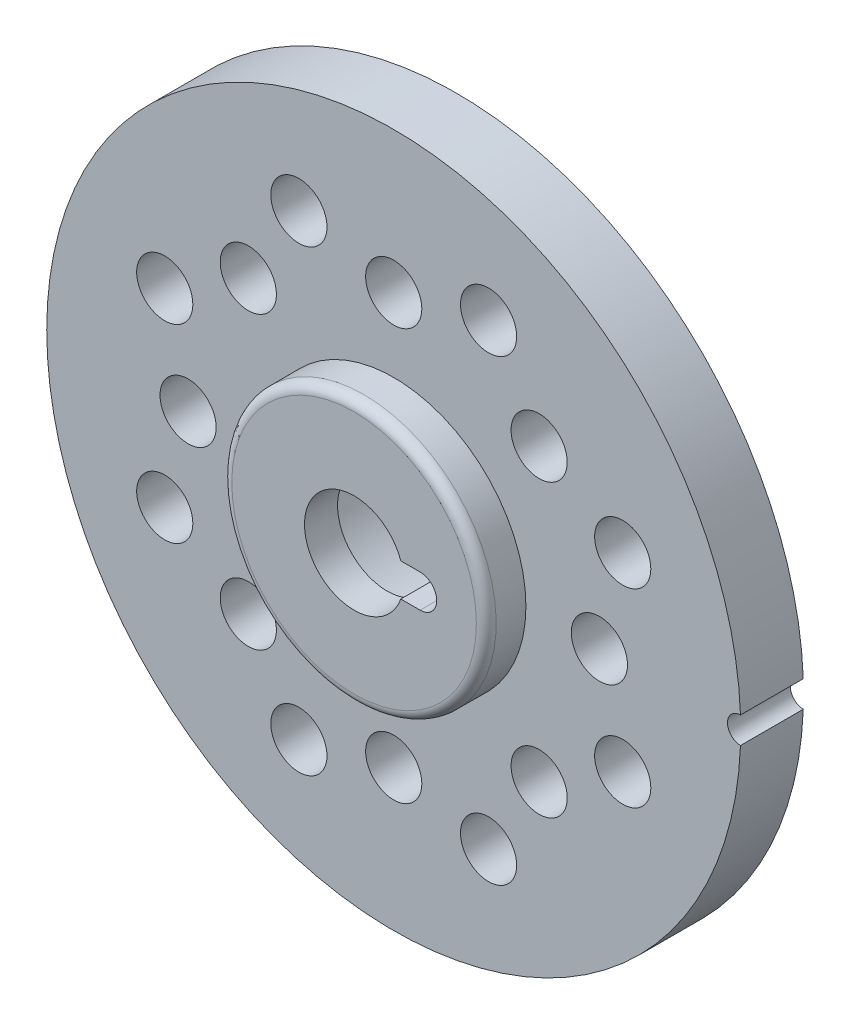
ISO-10303-21;
HEADER;
FILE_DESCRIPTION(('STEP AP214'),'2;1');
FILE_NAME('part.step','',(''),(''),'','','');
FILE_SCHEMA(('AUTOMOTIVE_DESIGN { 1 0 10303 214 1 1 1 1 }'));
ENDSEC;
DATA;
#1=APPLICATION_CONTEXT('core data for automotive mechanical design processes');
#2=APPLICATION_PROTOCOL_DEFINITION('international standard','automotive_design',2000,#1);
#3=PRODUCT_CONTEXT('',#1,'mechanical');
#4=PRODUCT('Part','Part','',(#3));
#5=PRODUCT_RELATED_PRODUCT_CATEGORY('part','',(#4));
#6=PRODUCT_DEFINITION_FORMATION('','',#4);
#7=PRODUCT_DEFINITION_CONTEXT('part definition',#1,'design');
#8=PRODUCT_DEFINITION('design','',#6,#7);
#9=PRODUCT_DEFINITION_SHAPE('','',#8);
#10=(LENGTH_UNIT() NAMED_UNIT(*) SI_UNIT(.MILLI.,.METRE.));
#11=(NAMED_UNIT(*) PLANE_ANGLE_UNIT() SI_UNIT($,.RADIAN.));
#12=(NAMED_UNIT(*) SI_UNIT($,.STERADIAN.) SOLID_ANGLE_UNIT());
#13=UNCERTAINTY_MEASURE_WITH_UNIT(LENGTH_MEASURE(1.E-05),#10,'distance_accuracy_value','');
#14=(GEOMETRIC_REPRESENTATION_CONTEXT(3) GLOBAL_UNCERTAINTY_ASSIGNED_CONTEXT((#13)) GLOBAL_UNIT_ASSIGNED_CONTEXT((#10,
#11,#12)) REPRESENTATION_CONTEXT('',''));
#15=CARTESIAN_POINT('',(0.,0.,0.));
#16=DIRECTION('',(0.,0.,1.));
#17=DIRECTION('',(1.,0.,0.));
#18=AXIS2_PLACEMENT_3D('',#15,#16,#17);
#19=CARTESIAN_POINT('',(1.91294517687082,0.744255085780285,0.200000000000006));
#20=DIRECTION('',(0.,0.,1.));
#21=DIRECTION('',(1.,0.,0.));
#22=AXIS2_PLACEMENT_3D('',#19,#20,#21);
#23=PLANE('',#22);
#24=CARTESIAN_POINT('',(0.,0.,0.200000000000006));
#25=DIRECTION('',(0.,0.,-1.));
#26=DIRECTION('',(-1.,0.,0.));
#27=AXIS2_PLACEMENT_3D('',#24,#25,#26);
#28=CIRCLE('',#27,3.);
#29=CARTESIAN_POINT('',(-3.,0.,0.200000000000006));
#30=VERTEX_POINT('',#29);
#31=EDGE_CURVE('E75',#30,#30,#28,.T.);
#32=ORIENTED_EDGE('',*,*,#31,.T.);
#33=EDGE_LOOP('',(#32));
#34=FACE_BOUND('',#33,.T.);
#35=DIRECTION('',(1.,0.,0.));
#36=VECTOR('',#35,1.);
#37=CARTESIAN_POINT('',(1.91294517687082,0.499999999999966,0.200000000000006));
#38=LINE('',#37,#36);
#39=CARTESIAN_POINT('',(1.41421356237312,0.499999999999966,0.200000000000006));
#40=VERTEX_POINT('',#39);
#41=CARTESIAN_POINT('',(2.00000000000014,0.499999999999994,0.200000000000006));
#42=VERTEX_POINT('',#41);
#43=EDGE_CURVE('E63',#40,#42,#38,.T.);
#44=ORIENTED_EDGE('',*,*,#43,.F.);
#45=CARTESIAN_POINT('',(0.,0.,0.200000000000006));
#46=DIRECTION('',(0.,0.,1.));
#47=DIRECTION('',(1.,0.,0.));
#48=AXIS2_PLACEMENT_3D('',#45,#46,#47);
#49=CIRCLE('',#48,1.5);
#50=CARTESIAN_POINT('',(1.4142135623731,-0.500000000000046,0.200000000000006));
#51=VERTEX_POINT('',#50);
#52=EDGE_CURVE('E88',#40,#51,#49,.T.);
#53=ORIENTED_EDGE('',*,*,#52,.T.);
#54=DIRECTION('',(1.,0.,0.));
#55=VECTOR('',#54,1.);
#56=CARTESIAN_POINT('',(1.91294517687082,-0.500000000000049,0.200000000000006));
#57=LINE('',#56,#55);
#58=CARTESIAN_POINT('',(2.00000000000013,-0.500000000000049,0.200000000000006));
#59=VERTEX_POINT('',#58);
#60=EDGE_CURVE('E79',#59,#51,#57,.F.);
#61=ORIENTED_EDGE('',*,*,#60,.F.);
#62=CARTESIAN_POINT('',(2.00000000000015,0.,0.200000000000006));
#63=DIRECTION('',(0.,0.,1.));
#64=DIRECTION('',(1.,0.,0.));
#65=AXIS2_PLACEMENT_3D('',#62,#63,#64);
#66=CIRCLE('',#65,0.5);
#67=EDGE_CURVE('E18',#42,#59,#66,.F.);
#68=ORIENTED_EDGE('',*,*,#67,.F.);
#69=EDGE_LOOP('',(#44,#53,#61,#68));
#70=FACE_BOUND('',#69,.T.);
#71=ADVANCED_FACE('F14',(#34,#70),#23,.F.);
#72=CARTESIAN_POINT('',(0.,0.,-3.5));
#73=DIRECTION('',(0.,0.,-1.));
#74=DIRECTION('',(-1.,0.,0.));
#75=AXIS2_PLACEMENT_3D('',#72,#73,#74);
#76=CYLINDRICAL_SURFACE('',#75,3.);
#77=ORIENTED_EDGE('',*,*,#31,.F.);
#78=EDGE_LOOP('',(#77));
#79=FACE_BOUND('',#78,.T.);
#80=CARTESIAN_POINT('',(0.,0.,-3.5));
#81=DIRECTION('',(0.,0.,-1.));
#82=DIRECTION('',(-1.,0.,0.));
#83=AXIS2_PLACEMENT_3D('',#80,#81,#82);
#84=CIRCLE('',#83,3.);
#85=CARTESIAN_POINT('',(-3.,0.,-3.5));
#86=VERTEX_POINT('',#85);
#87=EDGE_CURVE('E84',#86,#86,#84,.F.);
#88=ORIENTED_EDGE('',*,*,#87,.F.);
#89=EDGE_LOOP('',(#88));
#90=FACE_BOUND('',#89,.T.);
#91=ADVANCED_FACE('F223',(#79,#90),#76,.F.);
#92=CARTESIAN_POINT('',(0.,0.,-4.1640024));
#93=DIRECTION('',(0.,0.,1.));
#94=DIRECTION('',(1.,0.,0.));
#95=AXIS2_PLACEMENT_3D('',#92,#93,#94);
#96=CYLINDRICAL_SURFACE('',#95,1.5);
#97=DIRECTION('',(0.,0.,1.));
#98=VECTOR('',#97,1.);
#99=CARTESIAN_POINT('',(1.41421356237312,0.499999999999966,-4.01423999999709));
#100=LINE('',#99,#98);
#101=CARTESIAN_POINT('',(1.41421356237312,0.499999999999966,1.20000000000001));
#102=VERTEX_POINT('',#101);
#103=EDGE_CURVE('E218',#40,#102,#100,.T.);
#104=ORIENTED_EDGE('',*,*,#103,.T.);
#105=CARTESIAN_POINT('',(0.,0.,1.20000000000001));
#106=DIRECTION('',(0.,0.,1.));
#107=DIRECTION('',(1.,0.,0.));
#108=AXIS2_PLACEMENT_3D('',#105,#106,#107);
#109=CIRCLE('',#108,1.5);
#110=CARTESIAN_POINT('',(1.4142135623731,-0.500000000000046,1.20000000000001));
#111=VERTEX_POINT('',#110);
#112=EDGE_CURVE('E213',#111,#102,#109,.F.);
#113=ORIENTED_EDGE('',*,*,#112,.F.);
#114=DIRECTION('',(0.,0.,1.));
#115=VECTOR('',#114,1.);
#116=CARTESIAN_POINT('',(1.41421356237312,-0.500000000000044,-4.01423999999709));
#117=LINE('',#116,#115);
#118=EDGE_CURVE('E85',#111,#51,#117,.F.);
#119=ORIENTED_EDGE('',*,*,#118,.T.);
#120=ORIENTED_EDGE('',*,*,#52,.F.);
#121=EDGE_LOOP('',(#104,#113,#119,#120));
#122=FACE_BOUND('',#121,.T.);
#123=ADVANCED_FACE('F226',(#122),#96,.F.);
#124=CARTESIAN_POINT('',(0.,0.49999999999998,-4.01423999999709));
#125=DIRECTION('',(0.,1.,0.));
#126=DIRECTION('',(-1.,0.,0.));
#127=AXIS2_PLACEMENT_3D('',#124,#125,#126);
#128=PLANE('',#127);
#129=DIRECTION('',(1.,0.,0.));
#130=VECTOR('',#129,1.);
#131=CARTESIAN_POINT('',(0.0897356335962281,0.499999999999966,1.20000000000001));
#132=LINE('',#131,#130);
#133=CARTESIAN_POINT('',(2.00000000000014,0.499999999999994,1.20000000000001));
#134=VERTEX_POINT('',#133);
#135=EDGE_CURVE('E212',#102,#134,#132,.T.);
#136=ORIENTED_EDGE('',*,*,#135,.F.);
#137=ORIENTED_EDGE('',*,*,#103,.F.);
#138=ORIENTED_EDGE('',*,*,#43,.T.);
#139=DIRECTION('',(0.,0.,1.));
#140=VECTOR('',#139,1.);
#141=CARTESIAN_POINT('',(2.00000000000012,0.500000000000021,-4.01423999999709));
#142=LINE('',#141,#140);
#143=EDGE_CURVE('E72',#42,#134,#142,.T.);
#144=ORIENTED_EDGE('',*,*,#143,.T.);
#145=EDGE_LOOP('',(#136,#137,#138,#144));
#146=FACE_BOUND('',#145,.T.);
#147=ADVANCED_FACE('F297',(#146),#128,.F.);
#148=CARTESIAN_POINT('',(2.00000000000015,0.,-4.01423999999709));
#149=DIRECTION('',(0.,0.,1.));
#150=DIRECTION('',(1.,0.,0.));
#151=AXIS2_PLACEMENT_3D('',#148,#149,#150);
#152=CYLINDRICAL_SURFACE('',#151,0.5);
#153=ORIENTED_EDGE('',*,*,#67,.T.);
#154=DIRECTION('',(0.,0.,1.));
#155=VECTOR('',#154,1.);
#156=CARTESIAN_POINT('',(2.0000000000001,-0.500000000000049,-4.01423999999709));
#157=LINE('',#156,#155);
#158=CARTESIAN_POINT('',(2.00000000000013,-0.500000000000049,1.20000000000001));
#159=VERTEX_POINT('',#158);
#160=EDGE_CURVE('E70',#59,#159,#157,.T.);
#161=ORIENTED_EDGE('',*,*,#160,.T.);
#162=CARTESIAN_POINT('',(2.00000000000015,0.,1.20000000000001));
#163=DIRECTION('',(0.,0.,1.));
#164=DIRECTION('',(1.,0.,0.));
#165=AXIS2_PLACEMENT_3D('',#162,#163,#164);
#166=CIRCLE('',#165,0.5);
#167=EDGE_CURVE('E210',#134,#159,#166,.F.);
#168=ORIENTED_EDGE('',*,*,#167,.F.);
#169=ORIENTED_EDGE('',*,*,#143,.F.);
#170=EDGE_LOOP('',(#153,#161,#168,#169));
#171=FACE_BOUND('',#170,.T.);
#172=ADVANCED_FACE('F69',(#171),#152,.F.);
#173=CARTESIAN_POINT('',(2.00000000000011,-0.500000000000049,-4.01423999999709));
#174=DIRECTION('',(0.,-1.,0.));
#175=DIRECTION('',(1.,0.,0.));
#176=AXIS2_PLACEMENT_3D('',#173,#174,#175);
#177=PLANE('',#176);
#178=ORIENTED_EDGE('',*,*,#160,.F.);
#179=ORIENTED_EDGE('',*,*,#60,.T.);
#180=ORIENTED_EDGE('',*,*,#118,.F.);
#181=DIRECTION('',(1.,0.,0.));
#182=VECTOR('',#181,1.);
#183=CARTESIAN_POINT('',(0.0897356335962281,-0.500000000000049,1.20000000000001));
#184=LINE('',#183,#182);
#185=EDGE_CURVE('E82',#159,#111,#184,.F.);
#186=ORIENTED_EDGE('',*,*,#185,.F.);
#187=EDGE_LOOP('',(#178,#179,#180,#186));
#188=FACE_BOUND('',#187,.T.);
#189=ADVANCED_FACE('F77',(#188),#177,.F.);
#190=CARTESIAN_POINT('',(-2.10183847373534,-0.929286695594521,-3.5));
#191=DIRECTION('',(0.,0.,-1.));
#192=DIRECTION('',(-1.,0.,0.));
#193=AXIS2_PLACEMENT_3D('',#190,#191,#192);
#194=PLANE('',#193);
#195=ORIENTED_EDGE('',*,*,#87,.T.);
#196=EDGE_LOOP('',(#195));
#197=FACE_BOUND('',#196,.T.);
#198=CARTESIAN_POINT('',(0.,0.,-3.5));
#199=DIRECTION('',(0.,0.,-1.));
#200=DIRECTION('',(-1.,0.,0.));
#201=AXIS2_PLACEMENT_3D('',#198,#199,#200);
#202=CIRCLE('',#201,4.);
#203=CARTESIAN_POINT('',(-4.,0.,-3.5));
#204=VERTEX_POINT('',#203);
#205=EDGE_CURVE('E207',#204,#204,#202,.F.);
#206=ORIENTED_EDGE('',*,*,#205,.F.);
#207=EDGE_LOOP('',(#206));
#208=FACE_BOUND('',#207,.T.);
#209=ADVANCED_FACE('F230',(#197,#208),#194,.T.);
#210=CARTESIAN_POINT('',(0.0897356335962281,3.21649621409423,1.20000000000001));
#211=DIRECTION('',(0.,0.,1.));
#212=DIRECTION('',(1.,0.,0.));
#213=AXIS2_PLACEMENT_3D('',#210,#211,#212);
#214=PLANE('',#213);
#215=ORIENTED_EDGE('',*,*,#167,.T.);
#216=ORIENTED_EDGE('',*,*,#185,.T.);
#217=ORIENTED_EDGE('',*,*,#112,.T.);
#218=ORIENTED_EDGE('',*,*,#135,.T.);
#219=EDGE_LOOP('',(#215,#216,#217,#218));
#220=FACE_BOUND('',#219,.T.);
#221=CARTESIAN_POINT('',(0.,0.,1.20000000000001));
#222=DIRECTION('',(0.,0.,-1.));
#223=DIRECTION('',(0.,1.,0.));
#224=AXIS2_PLACEMENT_3D('',#221,#222,#223);
#225=CIRCLE('',#224,3.69999999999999);
#226=CARTESIAN_POINT('',(0.,3.69999999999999,1.20000000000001));
#227=VERTEX_POINT('',#226);
#228=EDGE_CURVE('E201',#227,#227,#225,.T.);
#229=ORIENTED_EDGE('',*,*,#228,.F.);
#230=EDGE_LOOP('',(#229));
#231=FACE_BOUND('',#230,.T.);
#232=ADVANCED_FACE('F233',(#220,#231),#214,.T.);
#233=CARTESIAN_POINT('',(0.,0.,3.3680024));
#234=DIRECTION('',(0.,0.,-1.));
#235=DIRECTION('',(-1.,0.,0.));
#236=AXIS2_PLACEMENT_3D('',#233,#234,#235);
#237=CYLINDRICAL_SURFACE('',#236,4.);
#238=ORIENTED_EDGE('',*,*,#205,.T.);
#239=EDGE_LOOP('',(#238));
#240=FACE_BOUND('',#239,.T.);
#241=CARTESIAN_POINT('',(0.,0.,-1.89999999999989));
#242=DIRECTION('',(0.,0.,-1.));
#243=DIRECTION('',(-1.,0.,0.));
#244=AXIS2_PLACEMENT_3D('',#241,#242,#243);
#245=CIRCLE('',#244,4.);
#246=CARTESIAN_POINT('',(-4.,0.,-1.89999999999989));
#247=VERTEX_POINT('',#246);
#248=EDGE_CURVE('E195',#247,#247,#245,.T.);
#249=ORIENTED_EDGE('',*,*,#248,.T.);
#250=EDGE_LOOP('',(#249));
#251=FACE_BOUND('',#250,.T.);
#252=ADVANCED_FACE('F237',(#240,#251),#237,.T.);
#253=CARTESIAN_POINT('',(10.5,-1.11022302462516E-13,-4.01423999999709));
#254=DIRECTION('',(0.,0.,1.));
#255=DIRECTION('',(1.,0.,0.));
#256=AXIS2_PLACEMENT_3D('',#253,#254,#255);
#257=CYLINDRICAL_SURFACE('',#256,0.399999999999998);
#258=DIRECTION('',(0.,0.,1.));
#259=VECTOR('',#258,1.);
#260=CARTESIAN_POINT('',(10.4923809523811,0.399927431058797,-4.01423999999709));
#261=LINE('',#260,#259);
#262=CARTESIAN_POINT('',(10.4923809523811,0.399927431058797,0.));
#263=VERTEX_POINT('',#262);
#264=CARTESIAN_POINT('',(10.4923809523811,0.399927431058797,-1.89999999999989));
#265=VERTEX_POINT('',#264);
#266=EDGE_CURVE('E204',#263,#265,#261,.F.);
#267=ORIENTED_EDGE('',*,*,#266,.F.);
#268=CARTESIAN_POINT('',(10.5,-1.11006868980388E-13,0.));
#269=DIRECTION('',(0.,0.,1.));
#270=DIRECTION('',(1.,0.,0.));
#271=AXIS2_PLACEMENT_3D('',#268,#269,#270);
#272=CIRCLE('',#271,0.399999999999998);
#273=CARTESIAN_POINT('',(10.492380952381,-0.399927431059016,0.));
#274=VERTEX_POINT('',#273);
#275=EDGE_CURVE('E205',#274,#263,#272,.F.);
#276=ORIENTED_EDGE('',*,*,#275,.F.);
#277=DIRECTION('',(0.,0.,1.));
#278=VECTOR('',#277,1.);
#279=CARTESIAN_POINT('',(10.492380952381,-0.399927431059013,0.));
#280=LINE('',#279,#278);
#281=CARTESIAN_POINT('',(10.492380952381,-0.399927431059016,-1.89999999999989));
#282=VERTEX_POINT('',#281);
#283=EDGE_CURVE('E191',#282,#274,#280,.T.);
#284=ORIENTED_EDGE('',*,*,#283,.F.);
#285=CARTESIAN_POINT('',(10.5,-1.1101417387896E-13,-1.89999999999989));
#286=DIRECTION('',(0.,0.,1.));
#287=DIRECTION('',(1.,0.,0.));
#288=AXIS2_PLACEMENT_3D('',#285,#286,#287);
#289=CIRCLE('',#288,0.399999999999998);
#290=EDGE_CURVE('E198',#282,#265,#289,.F.);
#291=ORIENTED_EDGE('',*,*,#290,.T.);
#292=EDGE_LOOP('',(#267,#276,#284,#291));
#293=FACE_BOUND('',#292,.T.);
#294=ADVANCED_FACE('F240',(#293),#257,.F.);
#295=CARTESIAN_POINT('',(0.,0.,0.900000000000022));
#296=DIRECTION('',(0.,0.,-1.));
#297=DIRECTION('',(0.,1.,0.));
#298=AXIS2_PLACEMENT_3D('',#295,#296,#297);
#299=TOROIDAL_SURFACE('',#298,3.69999999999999,0.300000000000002);
#300=ORIENTED_EDGE('',*,*,#228,.T.);
#301=EDGE_LOOP('',(#300));
#302=FACE_BOUND('',#301,.T.);
#303=CARTESIAN_POINT('',(0.,0.,0.900000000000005));
#304=DIRECTION('',(0.,0.,-1.));
#305=DIRECTION('',(-1.,0.,0.));
#306=AXIS2_PLACEMENT_3D('',#303,#304,#305);
#307=CIRCLE('',#306,4.);
#308=CARTESIAN_POINT('',(-4.,0.,0.900000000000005));
#309=VERTEX_POINT('',#308);
#310=EDGE_CURVE('E163',#309,#309,#307,.T.);
#311=ORIENTED_EDGE('',*,*,#310,.F.);
#312=EDGE_LOOP('',(#311));
#313=FACE_BOUND('',#312,.T.);
#314=ADVANCED_FACE('F16',(#302,#313),#299,.T.);
#315=CARTESIAN_POINT('',(-9.4075995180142,2.19747010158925,-1.89999999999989));
#316=DIRECTION('',(0.,0.,1.));
#317=DIRECTION('',(1.,0.,0.));
#318=AXIS2_PLACEMENT_3D('',#315,#316,#317);
#319=PLANE('',#318);
#320=CARTESIAN_POINT('',(6.92909649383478,2.8701257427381,-1.89999999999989));
#321=DIRECTION('',(0.,0.,1.));
#322=DIRECTION('',(1.,0.,0.));
#323=AXIS2_PLACEMENT_3D('',#320,#321,#322);
#324=CIRCLE('',#323,0.85);
#325=CARTESIAN_POINT('',(7.77909649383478,2.8701257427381,-1.89999999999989));
#326=VERTEX_POINT('',#325);
#327=EDGE_CURVE('E142',#326,#326,#324,.T.);
#328=ORIENTED_EDGE('',*,*,#327,.T.);
#329=EDGE_LOOP('',(#328));
#330=FACE_BOUND('',#329,.T.);
#331=ORIENTED_EDGE('',*,*,#248,.F.);
#332=EDGE_LOOP('',(#331));
#333=FACE_BOUND('',#332,.T.);
#334=CARTESIAN_POINT('',(6.22253967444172,0.,-1.89999999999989));
#335=DIRECTION('',(0.,0.,1.));
#336=DIRECTION('',(1.,0.,0.));
#337=AXIS2_PLACEMENT_3D('',#334,#335,#336);
#338=CIRCLE('',#337,0.85);
#339=CARTESIAN_POINT('',(7.07253967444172,0.,-1.89999999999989));
#340=VERTEX_POINT('',#339);
#341=EDGE_CURVE('E148',#340,#340,#338,.T.);
#342=ORIENTED_EDGE('',*,*,#341,.T.);
#343=EDGE_LOOP('',(#342));
#344=FACE_BOUND('',#343,.T.);
#345=CARTESIAN_POINT('',(4.40000000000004,-4.40000000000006,-1.89999999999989));
#346=DIRECTION('',(0.,0.,1.));
#347=DIRECTION('',(1.,0.,0.));
#348=AXIS2_PLACEMENT_3D('',#345,#346,#347);
#349=CIRCLE('',#348,0.85);
#350=CARTESIAN_POINT('',(5.25000000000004,-4.40000000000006,-1.89999999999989));
#351=VERTEX_POINT('',#350);
#352=EDGE_CURVE('E188',#351,#351,#349,.T.);
#353=ORIENTED_EDGE('',*,*,#352,.T.);
#354=EDGE_LOOP('',(#353));
#355=FACE_BOUND('',#354,.T.);
#356=CARTESIAN_POINT('',(2.0135736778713E-13,6.22253967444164,-1.89999999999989));
#357=DIRECTION('',(0.,0.,1.));
#358=DIRECTION('',(1.,0.,0.));
#359=AXIS2_PLACEMENT_3D('',#356,#357,#358);
#360=CIRCLE('',#359,0.85);
#361=CARTESIAN_POINT('',(0.850000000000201,6.22253967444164,-1.89999999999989));
#362=VERTEX_POINT('',#361);
#363=EDGE_CURVE('E157',#362,#362,#360,.T.);
#364=ORIENTED_EDGE('',*,*,#363,.T.);
#365=EDGE_LOOP('',(#364));
#366=FACE_BOUND('',#365,.T.);
#367=CARTESIAN_POINT('',(4.40000000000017,4.39999999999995,-1.89999999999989));
#368=DIRECTION('',(0.,0.,1.));
#369=DIRECTION('',(1.,0.,0.));
#370=AXIS2_PLACEMENT_3D('',#367,#368,#369);
#371=CIRCLE('',#370,0.85);
#372=CARTESIAN_POINT('',(5.25000000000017,4.39999999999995,-1.89999999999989));
#373=VERTEX_POINT('',#372);
#374=EDGE_CURVE('E154',#373,#373,#371,.T.);
#375=ORIENTED_EDGE('',*,*,#374,.T.);
#376=EDGE_LOOP('',(#375));
#377=FACE_BOUND('',#376,.T.);
#378=CARTESIAN_POINT('',(-4.39999999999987,-4.39999999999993,-1.89999999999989));
#379=DIRECTION('',(0.,0.,1.));
#380=DIRECTION('',(1.,0.,0.));
#381=AXIS2_PLACEMENT_3D('',#378,#379,#380);
#382=CIRCLE('',#381,0.85);
#383=CARTESIAN_POINT('',(-3.54999999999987,-4.39999999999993,-1.89999999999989));
#384=VERTEX_POINT('',#383);
#385=EDGE_CURVE('E160',#384,#384,#382,.T.);
#386=ORIENTED_EDGE('',*,*,#385,.T.);
#387=EDGE_LOOP('',(#386));
#388=FACE_BOUND('',#387,.T.);
#389=CARTESIAN_POINT('',(0.,-6.22253967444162,-1.89999999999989));
#390=DIRECTION('',(0.,0.,1.));
#391=DIRECTION('',(1.,0.,0.));
#392=AXIS2_PLACEMENT_3D('',#389,#390,#391);
#393=CIRCLE('',#392,0.85);
#394=CARTESIAN_POINT('',(0.850000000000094,-6.22253967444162,-1.89999999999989));
#395=VERTEX_POINT('',#394);
#396=EDGE_CURVE('E185',#395,#395,#393,.T.);
#397=ORIENTED_EDGE('',*,*,#396,.T.);
#398=EDGE_LOOP('',(#397));
#399=FACE_BOUND('',#398,.T.);
#400=CARTESIAN_POINT('',(-6.22253967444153,1.11030446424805E-13,-1.89999999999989));
#401=DIRECTION('',(0.,0.,1.));
#402=DIRECTION('',(1.,0.,0.));
#403=AXIS2_PLACEMENT_3D('',#400,#401,#402);
#404=CIRCLE('',#403,0.85);
#405=CARTESIAN_POINT('',(-5.37253967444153,1.11030446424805E-13,-1.89999999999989));
#406=VERTEX_POINT('',#405);
#407=EDGE_CURVE('E151',#406,#406,#404,.T.);
#408=ORIENTED_EDGE('',*,*,#407,.T.);
#409=EDGE_LOOP('',(#408));
#410=FACE_BOUND('',#409,.T.);
#411=CARTESIAN_POINT('',(-4.39999999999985,4.40000000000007,-1.89999999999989));
#412=DIRECTION('',(0.,0.,1.));
#413=DIRECTION('',(1.,0.,0.));
#414=AXIS2_PLACEMENT_3D('',#411,#412,#413);
#415=CIRCLE('',#414,0.85);
#416=CARTESIAN_POINT('',(-3.54999999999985,4.40000000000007,-1.89999999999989));
#417=VERTEX_POINT('',#416);
#418=EDGE_CURVE('E164',#417,#417,#415,.T.);
#419=ORIENTED_EDGE('',*,*,#418,.T.);
#420=EDGE_LOOP('',(#419));
#421=FACE_BOUND('',#420,.T.);
#422=CARTESIAN_POINT('',(2.87012574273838,6.92909649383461,-1.89999999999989));
#423=DIRECTION('',(0.,0.,1.));
#424=DIRECTION('',(1.,0.,0.));
#425=AXIS2_PLACEMENT_3D('',#422,#423,#424);
#426=CIRCLE('',#425,0.85);
#427=CARTESIAN_POINT('',(3.72012574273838,6.92909649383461,-1.89999999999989));
#428=VERTEX_POINT('',#427);
#429=EDGE_CURVE('E145',#428,#428,#426,.T.);
#430=ORIENTED_EDGE('',*,*,#429,.T.);
#431=EDGE_LOOP('',(#430));
#432=FACE_BOUND('',#431,.T.);
#433=CARTESIAN_POINT('',(-2.87012574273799,6.92909649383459,-1.89999999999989));
#434=DIRECTION('',(0.,0.,1.));
#435=DIRECTION('',(1.,0.,0.));
#436=AXIS2_PLACEMENT_3D('',#433,#434,#435);
#437=CIRCLE('',#436,0.85);
#438=CARTESIAN_POINT('',(-2.02012574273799,6.92909649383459,-1.89999999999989));
#439=VERTEX_POINT('',#438);
#440=EDGE_CURVE('E179',#439,#439,#437,.T.);
#441=ORIENTED_EDGE('',*,*,#440,.T.);
#442=EDGE_LOOP('',(#441));
#443=FACE_BOUND('',#442,.T.);
#444=CARTESIAN_POINT('',(-2.87012574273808,-6.92909649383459,-1.89999999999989));
#445=DIRECTION('',(0.,0.,1.));
#446=DIRECTION('',(1.,0.,0.));
#447=AXIS2_PLACEMENT_3D('',#444,#445,#446);
#448=CIRCLE('',#447,0.85);
#449=CARTESIAN_POINT('',(-2.02012574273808,-6.92909649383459,-1.89999999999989));
#450=VERTEX_POINT('',#449);
#451=EDGE_CURVE('E176',#450,#450,#448,.T.);
#452=ORIENTED_EDGE('',*,*,#451,.T.);
#453=EDGE_LOOP('',(#452));
#454=FACE_BOUND('',#453,.T.);
#455=CARTESIAN_POINT('',(-6.9290964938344,2.87012574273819,-1.89999999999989));
#456=DIRECTION('',(0.,0.,1.));
#457=DIRECTION('',(1.,0.,0.));
#458=AXIS2_PLACEMENT_3D('',#455,#456,#457);
#459=CIRCLE('',#458,0.85);
#460=CARTESIAN_POINT('',(-6.07909649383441,2.87012574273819,-1.89999999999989));
#461=VERTEX_POINT('',#460);
#462=EDGE_CURVE('E173',#461,#461,#459,.T.);
#463=ORIENTED_EDGE('',*,*,#462,.T.);
#464=EDGE_LOOP('',(#463));
#465=FACE_BOUND('',#464,.T.);
#466=CARTESIAN_POINT('',(2.87012574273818,-6.92909649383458,-1.89999999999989));
#467=DIRECTION('',(0.,0.,1.));
#468=DIRECTION('',(1.,0.,0.));
#469=AXIS2_PLACEMENT_3D('',#466,#467,#468);
#470=CIRCLE('',#469,0.85);
#471=CARTESIAN_POINT('',(3.72012574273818,-6.92909649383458,-1.89999999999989));
#472=VERTEX_POINT('',#471);
#473=EDGE_CURVE('E170',#472,#472,#470,.T.);
#474=ORIENTED_EDGE('',*,*,#473,.T.);
#475=EDGE_LOOP('',(#474));
#476=FACE_BOUND('',#475,.T.);
#477=CARTESIAN_POINT('',(6.9290964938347,-2.87012574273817,-1.89999999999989));
#478=DIRECTION('',(0.,0.,1.));
#479=DIRECTION('',(1.,0.,0.));
#480=AXIS2_PLACEMENT_3D('',#477,#478,#479);
#481=CIRCLE('',#480,0.85);
#482=CARTESIAN_POINT('',(7.7790964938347,-2.87012574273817,-1.89999999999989));
#483=VERTEX_POINT('',#482);
#484=EDGE_CURVE('E167',#483,#483,#481,.T.);
#485=ORIENTED_EDGE('',*,*,#484,.T.);
#486=EDGE_LOOP('',(#485));
#487=FACE_BOUND('',#486,.T.);
#488=CARTESIAN_POINT('',(-6.92909649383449,-2.87012574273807,-1.89999999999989));
#489=DIRECTION('',(0.,0.,1.));
#490=DIRECTION('',(1.,0.,0.));
#491=AXIS2_PLACEMENT_3D('',#488,#489,#490);
#492=CIRCLE('',#491,0.85);
#493=CARTESIAN_POINT('',(-6.07909649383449,-2.87012574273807,-1.89999999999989));
#494=VERTEX_POINT('',#493);
#495=EDGE_CURVE('E182',#494,#494,#492,.T.);
#496=ORIENTED_EDGE('',*,*,#495,.T.);
#497=EDGE_LOOP('',(#496));
#498=FACE_BOUND('',#497,.T.);
#499=ORIENTED_EDGE('',*,*,#290,.F.);
#500=CARTESIAN_POINT('',(0.,0.,-1.89999999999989));
#501=DIRECTION('',(0.,0.,1.));
#502=DIRECTION('',(1.,0.,0.));
#503=AXIS2_PLACEMENT_3D('',#500,#501,#502);
#504=CIRCLE('',#503,10.5);
#505=EDGE_CURVE('E192',#265,#282,#504,.T.);
#506=ORIENTED_EDGE('',*,*,#505,.F.);
#507=EDGE_LOOP('',(#499,#506));
#508=FACE_BOUND('',#507,.T.);
#509=ADVANCED_FACE('F244',(#330,#333,#344,#355,#366,#377,#388,#399,#410,#421,#432,#443,#454,
#465,#476,#487,#498,#508),#319,.F.);
#510=CARTESIAN_POINT('',(0.,0.,0.));
#511=DIRECTION('',(0.,0.,1.));
#512=DIRECTION('',(1.,0.,0.));
#513=AXIS2_PLACEMENT_3D('',#510,#511,#512);
#514=CYLINDRICAL_SURFACE('',#513,10.5);
#515=ORIENTED_EDGE('',*,*,#283,.T.);
#516=CARTESIAN_POINT('',(0.,0.,0.));
#517=DIRECTION('',(0.,0.,1.));
#518=DIRECTION('',(1.,0.,0.));
#519=AXIS2_PLACEMENT_3D('',#516,#517,#518);
#520=CIRCLE('',#519,10.5);
#521=EDGE_CURVE('E32',#263,#274,#520,.T.);
#522=ORIENTED_EDGE('',*,*,#521,.F.);
#523=ORIENTED_EDGE('',*,*,#266,.T.);
#524=ORIENTED_EDGE('',*,*,#505,.T.);
#525=EDGE_LOOP('',(#515,#522,#523,#524));
#526=FACE_BOUND('',#525,.T.);
#527=ADVANCED_FACE('F247',(#526),#514,.T.);
#528=CARTESIAN_POINT('',(4.40000000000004,-4.40000000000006,-4.0182399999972));
#529=DIRECTION('',(0.,0.,1.));
#530=DIRECTION('',(1.,0.,0.));
#531=AXIS2_PLACEMENT_3D('',#528,#529,#530);
#532=CYLINDRICAL_SURFACE('',#531,0.85);
#533=ORIENTED_EDGE('',*,*,#352,.F.);
#534=EDGE_LOOP('',(#533));
#535=FACE_BOUND('',#534,.T.);
#536=CARTESIAN_POINT('',(4.40000000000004,-4.40000000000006,0.));
#537=DIRECTION('',(0.,0.,1.));
#538=DIRECTION('',(1.,0.,0.));
#539=AXIS2_PLACEMENT_3D('',#536,#537,#538);
#540=CIRCLE('',#539,0.85);
#541=CARTESIAN_POINT('',(5.25000000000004,-4.40000000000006,0.));
#542=VERTEX_POINT('',#541);
#543=EDGE_CURVE('E138',#542,#542,#540,.F.);
#544=ORIENTED_EDGE('',*,*,#543,.F.);
#545=EDGE_LOOP('',(#544));
#546=FACE_BOUND('',#545,.T.);
#547=ADVANCED_FACE('F341',(#535,#546),#532,.F.);
#548=CARTESIAN_POINT('',(0.,-6.22253967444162,-4.0182399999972));
#549=DIRECTION('',(0.,0.,1.));
#550=DIRECTION('',(1.,0.,0.));
#551=AXIS2_PLACEMENT_3D('',#548,#549,#550);
#552=CYLINDRICAL_SURFACE('',#551,0.85);
#553=ORIENTED_EDGE('',*,*,#396,.F.);
#554=EDGE_LOOP('',(#553));
#555=FACE_BOUND('',#554,.T.);
#556=CARTESIAN_POINT('',(0.,-6.22253967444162,0.));
#557=DIRECTION('',(0.,0.,1.));
#558=DIRECTION('',(1.,0.,0.));
#559=AXIS2_PLACEMENT_3D('',#556,#557,#558);
#560=CIRCLE('',#559,0.85);
#561=CARTESIAN_POINT('',(0.850000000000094,-6.22253967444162,0.));
#562=VERTEX_POINT('',#561);
#563=EDGE_CURVE('E135',#562,#562,#560,.F.);
#564=ORIENTED_EDGE('',*,*,#563,.F.);
#565=EDGE_LOOP('',(#564));
#566=FACE_BOUND('',#565,.T.);
#567=ADVANCED_FACE('F343',(#555,#566),#552,.F.);
#568=CARTESIAN_POINT('',(-6.92909649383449,-2.87012574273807,-4.0182399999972));
#569=DIRECTION('',(0.,0.,1.));
#570=DIRECTION('',(1.,0.,0.));
#571=AXIS2_PLACEMENT_3D('',#568,#569,#570);
#572=CYLINDRICAL_SURFACE('',#571,0.85);
#573=ORIENTED_EDGE('',*,*,#495,.F.);
#574=EDGE_LOOP('',(#573));
#575=FACE_BOUND('',#574,.T.);
#576=CARTESIAN_POINT('',(-6.92909649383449,-2.87012574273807,0.));
#577=DIRECTION('',(0.,0.,1.));
#578=DIRECTION('',(1.,0.,0.));
#579=AXIS2_PLACEMENT_3D('',#576,#577,#578);
#580=CIRCLE('',#579,0.85);
#581=CARTESIAN_POINT('',(-6.07909649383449,-2.87012574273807,0.));
#582=VERTEX_POINT('',#581);
#583=EDGE_CURVE('E132',#582,#582,#580,.F.);
#584=ORIENTED_EDGE('',*,*,#583,.F.);
#585=EDGE_LOOP('',(#584));
#586=FACE_BOUND('',#585,.T.);
#587=ADVANCED_FACE('F351',(#575,#586),#572,.F.);
#588=CARTESIAN_POINT('',(-2.87012574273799,6.92909649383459,-4.0182399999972));
#589=DIRECTION('',(0.,0.,1.));
#590=DIRECTION('',(1.,0.,0.));
#591=AXIS2_PLACEMENT_3D('',#588,#589,#590);
#592=CYLINDRICAL_SURFACE('',#591,0.85);
#593=ORIENTED_EDGE('',*,*,#440,.F.);
#594=EDGE_LOOP('',(#593));
#595=FACE_BOUND('',#594,.T.);
#596=CARTESIAN_POINT('',(-2.87012574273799,6.92909649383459,0.));
#597=DIRECTION('',(0.,0.,1.));
#598=DIRECTION('',(1.,0.,0.));
#599=AXIS2_PLACEMENT_3D('',#596,#597,#598);
#600=CIRCLE('',#599,0.85);
#601=CARTESIAN_POINT('',(-2.02012574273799,6.92909649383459,0.));
#602=VERTEX_POINT('',#601);
#603=EDGE_CURVE('E129',#602,#602,#600,.F.);
#604=ORIENTED_EDGE('',*,*,#603,.F.);
#605=EDGE_LOOP('',(#604));
#606=FACE_BOUND('',#605,.T.);
#607=ADVANCED_FACE('F435',(#595,#606),#592,.F.);
#608=CARTESIAN_POINT('',(-2.87012574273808,-6.92909649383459,-4.0182399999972));
#609=DIRECTION('',(0.,0.,1.));
#610=DIRECTION('',(1.,0.,0.));
#611=AXIS2_PLACEMENT_3D('',#608,#609,#610);
#612=CYLINDRICAL_SURFACE('',#611,0.85);
#613=ORIENTED_EDGE('',*,*,#451,.F.);
#614=EDGE_LOOP('',(#613));
#615=FACE_BOUND('',#614,.T.);
#616=CARTESIAN_POINT('',(-2.87012574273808,-6.92909649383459,0.));
#617=DIRECTION('',(0.,0.,1.));
#618=DIRECTION('',(1.,0.,0.));
#619=AXIS2_PLACEMENT_3D('',#616,#617,#618);
#620=CIRCLE('',#619,0.85);
#621=CARTESIAN_POINT('',(-2.02012574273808,-6.92909649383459,0.));
#622=VERTEX_POINT('',#621);
#623=EDGE_CURVE('E126',#622,#622,#620,.F.);
#624=ORIENTED_EDGE('',*,*,#623,.F.);
#625=EDGE_LOOP('',(#624));
#626=FACE_BOUND('',#625,.T.);
#627=ADVANCED_FACE('F442',(#615,#626),#612,.F.);
#628=CARTESIAN_POINT('',(-6.9290964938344,2.87012574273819,-4.0182399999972));
#629=DIRECTION('',(0.,0.,1.));
#630=DIRECTION('',(1.,0.,0.));
#631=AXIS2_PLACEMENT_3D('',#628,#629,#630);
#632=CYLINDRICAL_SURFACE('',#631,0.85);
#633=ORIENTED_EDGE('',*,*,#462,.F.);
#634=EDGE_LOOP('',(#633));
#635=FACE_BOUND('',#634,.T.);
#636=CARTESIAN_POINT('',(-6.9290964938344,2.87012574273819,0.));
#637=DIRECTION('',(0.,0.,1.));
#638=DIRECTION('',(1.,0.,0.));
#639=AXIS2_PLACEMENT_3D('',#636,#637,#638);
#640=CIRCLE('',#639,0.85);
#641=CARTESIAN_POINT('',(-6.07909649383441,2.87012574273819,0.));
#642=VERTEX_POINT('',#641);
#643=EDGE_CURVE('E123',#642,#642,#640,.F.);
#644=ORIENTED_EDGE('',*,*,#643,.F.);
#645=EDGE_LOOP('',(#644));
#646=FACE_BOUND('',#645,.T.);
#647=ADVANCED_FACE('F450',(#635,#646),#632,.F.);
#648=CARTESIAN_POINT('',(2.87012574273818,-6.92909649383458,-4.0182399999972));
#649=DIRECTION('',(0.,0.,1.));
#650=DIRECTION('',(1.,0.,0.));
#651=AXIS2_PLACEMENT_3D('',#648,#649,#650);
#652=CYLINDRICAL_SURFACE('',#651,0.85);
#653=ORIENTED_EDGE('',*,*,#473,.F.);
#654=EDGE_LOOP('',(#653));
#655=FACE_BOUND('',#654,.T.);
#656=CARTESIAN_POINT('',(2.87012574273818,-6.92909649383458,0.));
#657=DIRECTION('',(0.,0.,1.));
#658=DIRECTION('',(1.,0.,0.));
#659=AXIS2_PLACEMENT_3D('',#656,#657,#658);
#660=CIRCLE('',#659,0.85);
#661=CARTESIAN_POINT('',(3.72012574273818,-6.92909649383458,0.));
#662=VERTEX_POINT('',#661);
#663=EDGE_CURVE('E120',#662,#662,#660,.F.);
#664=ORIENTED_EDGE('',*,*,#663,.F.);
#665=EDGE_LOOP('',(#664));
#666=FACE_BOUND('',#665,.T.);
#667=ADVANCED_FACE('F458',(#655,#666),#652,.F.);
#668=CARTESIAN_POINT('',(6.9290964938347,-2.87012574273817,-4.0182399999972));
#669=DIRECTION('',(0.,0.,1.));
#670=DIRECTION('',(1.,0.,0.));
#671=AXIS2_PLACEMENT_3D('',#668,#669,#670);
#672=CYLINDRICAL_SURFACE('',#671,0.85);
#673=ORIENTED_EDGE('',*,*,#484,.F.);
#674=EDGE_LOOP('',(#673));
#675=FACE_BOUND('',#674,.T.);
#676=CARTESIAN_POINT('',(6.9290964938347,-2.87012574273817,0.));
#677=DIRECTION('',(0.,0.,1.));
#678=DIRECTION('',(1.,0.,0.));
#679=AXIS2_PLACEMENT_3D('',#676,#677,#678);
#680=CIRCLE('',#679,0.85);
#681=CARTESIAN_POINT('',(7.7790964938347,-2.87012574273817,0.));
#682=VERTEX_POINT('',#681);
#683=EDGE_CURVE('E117',#682,#682,#680,.F.);
#684=ORIENTED_EDGE('',*,*,#683,.F.);
#685=EDGE_LOOP('',(#684));
#686=FACE_BOUND('',#685,.T.);
#687=ADVANCED_FACE('F466',(#675,#686),#672,.F.);
#688=CARTESIAN_POINT('',(-4.39999999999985,4.40000000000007,-4.0182399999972));
#689=DIRECTION('',(0.,0.,1.));
#690=DIRECTION('',(1.,0.,0.));
#691=AXIS2_PLACEMENT_3D('',#688,#689,#690);
#692=CYLINDRICAL_SURFACE('',#691,0.85);
#693=ORIENTED_EDGE('',*,*,#418,.F.);
#694=EDGE_LOOP('',(#693));
#695=FACE_BOUND('',#694,.T.);
#696=CARTESIAN_POINT('',(-4.39999999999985,4.40000000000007,0.));
#697=DIRECTION('',(0.,0.,1.));
#698=DIRECTION('',(1.,0.,0.));
#699=AXIS2_PLACEMENT_3D('',#696,#697,#698);
#700=CIRCLE('',#699,0.85);
#701=CARTESIAN_POINT('',(-3.54999999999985,4.40000000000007,0.));
#702=VERTEX_POINT('',#701);
#703=EDGE_CURVE('E114',#702,#702,#700,.F.);
#704=ORIENTED_EDGE('',*,*,#703,.F.);
#705=EDGE_LOOP('',(#704));
#706=FACE_BOUND('',#705,.T.);
#707=ADVANCED_FACE('F313',(#695,#706),#692,.F.);
#708=CARTESIAN_POINT('',(0.,0.,1.20000000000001));
#709=DIRECTION('',(0.,0.,-1.));
#710=DIRECTION('',(-1.,0.,0.));
#711=AXIS2_PLACEMENT_3D('',#708,#709,#710);
#712=CYLINDRICAL_SURFACE('',#711,4.);
#713=ORIENTED_EDGE('',*,*,#310,.T.);
#714=EDGE_LOOP('',(#713));
#715=FACE_BOUND('',#714,.T.);
#716=CARTESIAN_POINT('',(0.,0.,0.));
#717=DIRECTION('',(0.,0.,-1.));
#718=DIRECTION('',(-1.,0.,0.));
#719=AXIS2_PLACEMENT_3D('',#716,#717,#718);
#720=CIRCLE('',#719,4.);
#721=CARTESIAN_POINT('',(-4.,0.,0.));
#722=VERTEX_POINT('',#721);
#723=EDGE_CURVE('E111',#722,#722,#720,.T.);
#724=ORIENTED_EDGE('',*,*,#723,.F.);
#725=EDGE_LOOP('',(#724));
#726=FACE_BOUND('',#725,.T.);
#727=ADVANCED_FACE('F309',(#715,#726),#712,.T.);
#728=CARTESIAN_POINT('',(-4.39999999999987,-4.39999999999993,-4.0182399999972));
#729=DIRECTION('',(0.,0.,1.));
#730=DIRECTION('',(1.,0.,0.));
#731=AXIS2_PLACEMENT_3D('',#728,#729,#730);
#732=CYLINDRICAL_SURFACE('',#731,0.85);
#733=ORIENTED_EDGE('',*,*,#385,.F.);
#734=EDGE_LOOP('',(#733));
#735=FACE_BOUND('',#734,.T.);
#736=CARTESIAN_POINT('',(-4.39999999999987,-4.39999999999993,0.));
#737=DIRECTION('',(0.,0.,1.));
#738=DIRECTION('',(1.,0.,0.));
#739=AXIS2_PLACEMENT_3D('',#736,#737,#738);
#740=CIRCLE('',#739,0.85);
#741=CARTESIAN_POINT('',(-3.54999999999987,-4.39999999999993,0.));
#742=VERTEX_POINT('',#741);
#743=EDGE_CURVE('E108',#742,#742,#740,.F.);
#744=ORIENTED_EDGE('',*,*,#743,.F.);
#745=EDGE_LOOP('',(#744));
#746=FACE_BOUND('',#745,.T.);
#747=ADVANCED_FACE('F312',(#735,#746),#732,.F.);
#748=CARTESIAN_POINT('',(2.0122792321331E-13,6.22253967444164,-4.0182399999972));
#749=DIRECTION('',(0.,0.,1.));
#750=DIRECTION('',(1.,0.,0.));
#751=AXIS2_PLACEMENT_3D('',#748,#749,#750);
#752=CYLINDRICAL_SURFACE('',#751,0.85);
#753=ORIENTED_EDGE('',*,*,#363,.F.);
#754=EDGE_LOOP('',(#753));
#755=FACE_BOUND('',#754,.T.);
#756=CARTESIAN_POINT('',(2.01473475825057E-13,6.22253967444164,0.));
#757=DIRECTION('',(0.,0.,1.));
#758=DIRECTION('',(1.,0.,0.));
#759=AXIS2_PLACEMENT_3D('',#756,#757,#758);
#760=CIRCLE('',#759,0.85);
#761=CARTESIAN_POINT('',(0.850000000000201,6.22253967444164,0.));
#762=VERTEX_POINT('',#761);
#763=EDGE_CURVE('E105',#762,#762,#760,.F.);
#764=ORIENTED_EDGE('',*,*,#763,.F.);
#765=EDGE_LOOP('',(#764));
#766=FACE_BOUND('',#765,.T.);
#767=ADVANCED_FACE('F492',(#755,#766),#752,.F.);
#768=CARTESIAN_POINT('',(4.40000000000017,4.39999999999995,-4.0182399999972));
#769=DIRECTION('',(0.,0.,1.));
#770=DIRECTION('',(1.,0.,0.));
#771=AXIS2_PLACEMENT_3D('',#768,#769,#770);
#772=CYLINDRICAL_SURFACE('',#771,0.85);
#773=ORIENTED_EDGE('',*,*,#374,.F.);
#774=EDGE_LOOP('',(#773));
#775=FACE_BOUND('',#774,.T.);
#776=CARTESIAN_POINT('',(4.40000000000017,4.39999999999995,0.));
#777=DIRECTION('',(0.,0.,1.));
#778=DIRECTION('',(1.,0.,0.));
#779=AXIS2_PLACEMENT_3D('',#776,#777,#778);
#780=CIRCLE('',#779,0.85);
#781=CARTESIAN_POINT('',(5.25000000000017,4.39999999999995,0.));
#782=VERTEX_POINT('',#781);
#783=EDGE_CURVE('E102',#782,#782,#780,.F.);
#784=ORIENTED_EDGE('',*,*,#783,.F.);
#785=EDGE_LOOP('',(#784));
#786=FACE_BOUND('',#785,.T.);
#787=ADVANCED_FACE('F500',(#775,#786),#772,.F.);
#788=CARTESIAN_POINT('',(-6.22253967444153,1.11022302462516E-13,-4.0182399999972));
#789=DIRECTION('',(0.,0.,1.));
#790=DIRECTION('',(1.,0.,0.));
#791=AXIS2_PLACEMENT_3D('',#788,#789,#790);
#792=CYLINDRICAL_SURFACE('',#791,0.85);
#793=ORIENTED_EDGE('',*,*,#407,.F.);
#794=EDGE_LOOP('',(#793));
#795=FACE_BOUND('',#794,.T.);
#796=CARTESIAN_POINT('',(-6.22253967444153,1.11037751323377E-13,0.));
#797=DIRECTION('',(0.,0.,1.));
#798=DIRECTION('',(1.,0.,0.));
#799=AXIS2_PLACEMENT_3D('',#796,#797,#798);
#800=CIRCLE('',#799,0.85);
#801=CARTESIAN_POINT('',(-5.37253967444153,1.11037751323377E-13,0.));
#802=VERTEX_POINT('',#801);
#803=EDGE_CURVE('E99',#802,#802,#800,.F.);
#804=ORIENTED_EDGE('',*,*,#803,.F.);
#805=EDGE_LOOP('',(#804));
#806=FACE_BOUND('',#805,.T.);
#807=ADVANCED_FACE('F508',(#795,#806),#792,.F.);
#808=CARTESIAN_POINT('',(6.22253967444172,0.,-4.0182399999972));
#809=DIRECTION('',(0.,0.,1.));
#810=DIRECTION('',(1.,0.,0.));
#811=AXIS2_PLACEMENT_3D('',#808,#809,#810);
#812=CYLINDRICAL_SURFACE('',#811,0.85);
#813=ORIENTED_EDGE('',*,*,#341,.F.);
#814=EDGE_LOOP('',(#813));
#815=FACE_BOUND('',#814,.T.);
#816=CARTESIAN_POINT('',(6.22253967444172,0.,0.));
#817=DIRECTION('',(0.,0.,1.));
#818=DIRECTION('',(1.,0.,0.));
#819=AXIS2_PLACEMENT_3D('',#816,#817,#818);
#820=CIRCLE('',#819,0.85);
#821=CARTESIAN_POINT('',(7.07253967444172,0.,0.));
#822=VERTEX_POINT('',#821);
#823=EDGE_CURVE('E96',#822,#822,#820,.F.);
#824=ORIENTED_EDGE('',*,*,#823,.F.);
#825=EDGE_LOOP('',(#824));
#826=FACE_BOUND('',#825,.T.);
#827=ADVANCED_FACE('F516',(#815,#826),#812,.F.);
#828=CARTESIAN_POINT('',(2.87012574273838,6.92909649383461,-4.0182399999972));
#829=DIRECTION('',(0.,0.,1.));
#830=DIRECTION('',(1.,0.,0.));
#831=AXIS2_PLACEMENT_3D('',#828,#829,#830);
#832=CYLINDRICAL_SURFACE('',#831,0.85);
#833=ORIENTED_EDGE('',*,*,#429,.F.);
#834=EDGE_LOOP('',(#833));
#835=FACE_BOUND('',#834,.T.);
#836=CARTESIAN_POINT('',(2.87012574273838,6.92909649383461,0.));
#837=DIRECTION('',(0.,0.,1.));
#838=DIRECTION('',(1.,0.,0.));
#839=AXIS2_PLACEMENT_3D('',#836,#837,#838);
#840=CIRCLE('',#839,0.85);
#841=CARTESIAN_POINT('',(3.72012574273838,6.92909649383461,0.));
#842=VERTEX_POINT('',#841);
#843=EDGE_CURVE('E24',#842,#842,#840,.F.);
#844=ORIENTED_EDGE('',*,*,#843,.F.);
#845=EDGE_LOOP('',(#844));
#846=FACE_BOUND('',#845,.T.);
#847=ADVANCED_FACE('F524',(#835,#846),#832,.F.);
#848=CARTESIAN_POINT('',(6.92909649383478,2.8701257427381,-4.0182399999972));
#849=DIRECTION('',(0.,0.,1.));
#850=DIRECTION('',(1.,0.,0.));
#851=AXIS2_PLACEMENT_3D('',#848,#849,#850);
#852=CYLINDRICAL_SURFACE('',#851,0.85);
#853=ORIENTED_EDGE('',*,*,#327,.F.);
#854=EDGE_LOOP('',(#853));
#855=FACE_BOUND('',#854,.T.);
#856=CARTESIAN_POINT('',(6.92909649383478,2.8701257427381,0.));
#857=DIRECTION('',(0.,0.,1.));
#858=DIRECTION('',(1.,0.,0.));
#859=AXIS2_PLACEMENT_3D('',#856,#857,#858);
#860=CIRCLE('',#859,0.85);
#861=CARTESIAN_POINT('',(7.77909649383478,2.8701257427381,0.));
#862=VERTEX_POINT('',#861);
#863=EDGE_CURVE('E9',#862,#862,#860,.F.);
#864=ORIENTED_EDGE('',*,*,#863,.F.);
#865=EDGE_LOOP('',(#864));
#866=FACE_BOUND('',#865,.T.);
#867=ADVANCED_FACE('F320',(#855,#866),#852,.F.);
#868=CARTESIAN_POINT('',(-2.22719949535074,6.700711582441,0.));
#869=DIRECTION('',(0.,0.,1.));
#870=DIRECTION('',(1.,0.,0.));
#871=AXIS2_PLACEMENT_3D('',#868,#869,#870);
#872=PLANE('',#871);
#873=ORIENTED_EDGE('',*,*,#863,.T.);
#874=EDGE_LOOP('',(#873));
#875=FACE_BOUND('',#874,.T.);
#876=ORIENTED_EDGE('',*,*,#843,.T.);
#877=EDGE_LOOP('',(#876));
#878=FACE_BOUND('',#877,.T.);
#879=ORIENTED_EDGE('',*,*,#823,.T.);
#880=EDGE_LOOP('',(#879));
#881=FACE_BOUND('',#880,.T.);
#882=ORIENTED_EDGE('',*,*,#803,.T.);
#883=EDGE_LOOP('',(#882));
#884=FACE_BOUND('',#883,.T.);
#885=ORIENTED_EDGE('',*,*,#783,.T.);
#886=EDGE_LOOP('',(#885));
#887=FACE_BOUND('',#886,.T.);
#888=ORIENTED_EDGE('',*,*,#763,.T.);
#889=EDGE_LOOP('',(#888));
#890=FACE_BOUND('',#889,.T.);
#891=ORIENTED_EDGE('',*,*,#743,.T.);
#892=EDGE_LOOP('',(#891));
#893=FACE_BOUND('',#892,.T.);
#894=ORIENTED_EDGE('',*,*,#723,.T.);
#895=EDGE_LOOP('',(#894));
#896=FACE_BOUND('',#895,.T.);
#897=ORIENTED_EDGE('',*,*,#703,.T.);
#898=EDGE_LOOP('',(#897));
#899=FACE_BOUND('',#898,.T.);
#900=ORIENTED_EDGE('',*,*,#683,.T.);
#901=EDGE_LOOP('',(#900));
#902=FACE_BOUND('',#901,.T.);
#903=ORIENTED_EDGE('',*,*,#663,.T.);
#904=EDGE_LOOP('',(#903));
#905=FACE_BOUND('',#904,.T.);
#906=ORIENTED_EDGE('',*,*,#643,.T.);
#907=EDGE_LOOP('',(#906));
#908=FACE_BOUND('',#907,.T.);
#909=ORIENTED_EDGE('',*,*,#623,.T.);
#910=EDGE_LOOP('',(#909));
#911=FACE_BOUND('',#910,.T.);
#912=ORIENTED_EDGE('',*,*,#603,.T.);
#913=EDGE_LOOP('',(#912));
#914=FACE_BOUND('',#913,.T.);
#915=ORIENTED_EDGE('',*,*,#583,.T.);
#916=EDGE_LOOP('',(#915));
#917=FACE_BOUND('',#916,.T.);
#918=ORIENTED_EDGE('',*,*,#563,.T.);
#919=EDGE_LOOP('',(#918));
#920=FACE_BOUND('',#919,.T.);
#921=ORIENTED_EDGE('',*,*,#543,.T.);
#922=EDGE_LOOP('',(#921));
#923=FACE_BOUND('',#922,.T.);
#924=ORIENTED_EDGE('',*,*,#521,.T.);
#925=ORIENTED_EDGE('',*,*,#275,.T.);
#926=EDGE_LOOP('',(#924,#925));
#927=FACE_BOUND('',#926,.T.);
#928=ADVANCED_FACE('F317',(#875,#878,#881,#884,#887,#890,#893,#896,#899,#902,#905,#908,#911,
#914,#917,#920,#923,#927),#872,.T.);
#929=CLOSED_SHELL('',(#71,#91,#123,#147,#172,#189,#209,#232,#252,#294,#314,#509,#527,#547,#567,
#587,#607,#627,#647,#667,#687,#707,#727,#747,#767,#787,#807,#827,#847,#867,#928));
#930=MANIFOLD_SOLID_BREP('B1',#929);
#931=ADVANCED_BREP_SHAPE_REPRESENTATION('',(#18,#930),#14);
#932=SHAPE_DEFINITION_REPRESENTATION(#9,#931);
ENDSEC;
END-ISO-10303-21;
